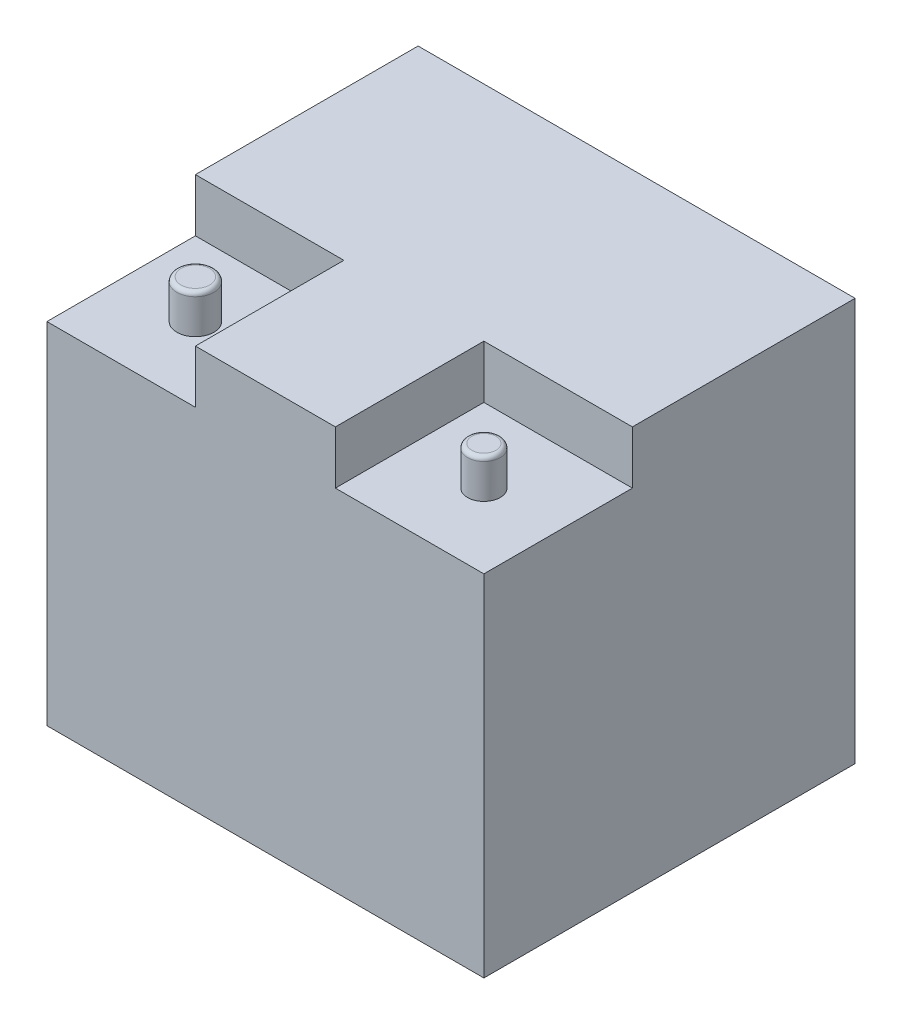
ISO-10303-21;
HEADER;
FILE_DESCRIPTION(('STEP AP214'),'2;1');
FILE_NAME('part.step','',(''),(''),'','','');
FILE_SCHEMA(('AUTOMOTIVE_DESIGN { 1 0 10303 214 1 1 1 1 }'));
ENDSEC;
DATA;
#1=APPLICATION_CONTEXT('core data for automotive mechanical design processes');
#2=APPLICATION_PROTOCOL_DEFINITION('international standard','automotive_design',2000,#1);
#3=PRODUCT_CONTEXT('',#1,'mechanical');
#4=PRODUCT('Part','Part','',(#3));
#5=PRODUCT_RELATED_PRODUCT_CATEGORY('part','',(#4));
#6=PRODUCT_DEFINITION_FORMATION('','',#4);
#7=PRODUCT_DEFINITION_CONTEXT('part definition',#1,'design');
#8=PRODUCT_DEFINITION('design','',#6,#7);
#9=PRODUCT_DEFINITION_SHAPE('','',#8);
#10=(LENGTH_UNIT() NAMED_UNIT(*) SI_UNIT(.MILLI.,.METRE.));
#11=(NAMED_UNIT(*) PLANE_ANGLE_UNIT() SI_UNIT($,.RADIAN.));
#12=(NAMED_UNIT(*) SI_UNIT($,.STERADIAN.) SOLID_ANGLE_UNIT());
#13=UNCERTAINTY_MEASURE_WITH_UNIT(LENGTH_MEASURE(1.E-05),#10,'distance_accuracy_value','');
#14=(GEOMETRIC_REPRESENTATION_CONTEXT(3) GLOBAL_UNCERTAINTY_ASSIGNED_CONTEXT((#13)) GLOBAL_UNIT_ASSIGNED_CONTEXT((#10,
#11,#12)) REPRESENTATION_CONTEXT('',''));
#15=CARTESIAN_POINT('',(0.,0.,0.));
#16=DIRECTION('',(0.,0.,1.));
#17=DIRECTION('',(1.,0.,0.));
#18=AXIS2_PLACEMENT_3D('',#15,#16,#17);
#19=CARTESIAN_POINT('',(33.,165.,87.5));
#20=DIRECTION('',(0.,-1.,0.));
#21=DIRECTION('',(0.,0.,-1.));
#22=AXIS2_PLACEMENT_3D('',#19,#20,#21);
#23=PLANE('',#22);
#24=DIRECTION('',(0.,0.,1.));
#25=VECTOR('',#24,1.);
#26=CARTESIAN_POINT('',(33.,165.,87.5));
#27=LINE('',#26,#25);
#28=CARTESIAN_POINT('',(33.,165.,17.5));
#29=VERTEX_POINT('',#28);
#30=CARTESIAN_POINT('',(33.,165.,87.5));
#31=VERTEX_POINT('',#30);
#32=EDGE_CURVE('E274',#29,#31,#27,.T.);
#33=ORIENTED_EDGE('',*,*,#32,.T.);
#34=DIRECTION('',(1.,0.,0.));
#35=VECTOR('',#34,1.);
#36=CARTESIAN_POINT('',(33.,165.,87.5));
#37=LINE('',#36,#35);
#38=CARTESIAN_POINT('',(103.,165.,87.5));
#39=VERTEX_POINT('',#38);
#40=EDGE_CURVE('E127',#31,#39,#37,.T.);
#41=ORIENTED_EDGE('',*,*,#40,.T.);
#42=DIRECTION('',(0.,0.,-1.));
#43=VECTOR('',#42,1.);
#44=CARTESIAN_POINT('',(103.,165.,87.5));
#45=LINE('',#44,#43);
#46=CARTESIAN_POINT('',(103.,165.,17.5));
#47=VERTEX_POINT('',#46);
#48=EDGE_CURVE('E270',#39,#47,#45,.T.);
#49=ORIENTED_EDGE('',*,*,#48,.T.);
#50=DIRECTION('',(-1.,0.,0.));
#51=VECTOR('',#50,1.);
#52=CARTESIAN_POINT('',(33.,165.,17.5));
#53=LINE('',#52,#51);
#54=EDGE_CURVE('E128',#47,#29,#53,.T.);
#55=ORIENTED_EDGE('',*,*,#54,.T.);
#56=EDGE_LOOP('',(#33,#41,#49,#55));
#57=FACE_BOUND('',#56,.T.);
#58=CARTESIAN_POINT('',(68.,165.,52.5));
#59=DIRECTION('',(0.,-1.,0.));
#60=DIRECTION('',(0.,0.,-1.));
#61=AXIS2_PLACEMENT_3D('',#58,#59,#60);
#62=CIRCLE('',#61,7.7);
#63=CARTESIAN_POINT('',(68.,165.,44.8));
#64=VERTEX_POINT('',#63);
#65=EDGE_CURVE('E157',#64,#64,#62,.F.);
#66=ORIENTED_EDGE('',*,*,#65,.F.);
#67=EDGE_LOOP('',(#66));
#68=FACE_BOUND('',#67,.T.);
#69=ADVANCED_FACE('F31',(#57,#68),#23,.F.);
#70=CARTESIAN_POINT('',(-103.,165.,17.5));
#71=DIRECTION('',(0.,-1.,0.));
#72=DIRECTION('',(0.,0.,-1.));
#73=AXIS2_PLACEMENT_3D('',#70,#71,#72);
#74=PLANE('',#73);
#75=DIRECTION('',(0.,0.,1.));
#76=VECTOR('',#75,1.);
#77=CARTESIAN_POINT('',(-103.,165.,87.5));
#78=LINE('',#77,#76);
#79=CARTESIAN_POINT('',(-103.,165.,17.5));
#80=VERTEX_POINT('',#79);
#81=CARTESIAN_POINT('',(-103.,165.,87.5));
#82=VERTEX_POINT('',#81);
#83=EDGE_CURVE('E230',#80,#82,#78,.T.);
#84=ORIENTED_EDGE('',*,*,#83,.T.);
#85=DIRECTION('',(1.,0.,0.));
#86=VECTOR('',#85,1.);
#87=CARTESIAN_POINT('',(-103.,165.,87.5));
#88=LINE('',#87,#86);
#89=CARTESIAN_POINT('',(-33.,165.,87.5));
#90=VERTEX_POINT('',#89);
#91=EDGE_CURVE('E237',#82,#90,#88,.T.);
#92=ORIENTED_EDGE('',*,*,#91,.T.);
#93=DIRECTION('',(0.,0.,-1.));
#94=VECTOR('',#93,1.);
#95=CARTESIAN_POINT('',(-33.,165.,87.5));
#96=LINE('',#95,#94);
#97=CARTESIAN_POINT('',(-33.,165.,17.5));
#98=VERTEX_POINT('',#97);
#99=EDGE_CURVE('E240',#90,#98,#96,.T.);
#100=ORIENTED_EDGE('',*,*,#99,.T.);
#101=DIRECTION('',(-1.,0.,0.));
#102=VECTOR('',#101,1.);
#103=CARTESIAN_POINT('',(-103.,165.,17.5));
#104=LINE('',#103,#102);
#105=EDGE_CURVE('E247',#98,#80,#104,.T.);
#106=ORIENTED_EDGE('',*,*,#105,.T.);
#107=EDGE_LOOP('',(#84,#92,#100,#106));
#108=FACE_BOUND('',#107,.T.);
#109=CARTESIAN_POINT('',(-68.,165.,52.5));
#110=DIRECTION('',(0.,-1.,0.));
#111=DIRECTION('',(0.,0.,-1.));
#112=AXIS2_PLACEMENT_3D('',#109,#110,#111);
#113=CIRCLE('',#112,8.75000000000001);
#114=CARTESIAN_POINT('',(-68.,165.,43.75));
#115=VERTEX_POINT('',#114);
#116=EDGE_CURVE('E154',#115,#115,#113,.F.);
#117=ORIENTED_EDGE('',*,*,#116,.F.);
#118=EDGE_LOOP('',(#117));
#119=FACE_BOUND('',#118,.T.);
#120=ADVANCED_FACE('F182',(#108,#119),#74,.F.);
#121=CARTESIAN_POINT('',(-103.,190.,-87.5));
#122=DIRECTION('',(1.,0.,0.));
#123=DIRECTION('',(0.,0.,-1.));
#124=AXIS2_PLACEMENT_3D('',#121,#122,#123);
#125=PLANE('',#124);
#126=ORIENTED_EDGE('',*,*,#83,.F.);
#127=DIRECTION('',(0.,1.,0.));
#128=VECTOR('',#127,1.);
#129=CARTESIAN_POINT('',(-103.,165.,17.5));
#130=LINE('',#129,#128);
#131=CARTESIAN_POINT('',(-103.,190.,17.5));
#132=VERTEX_POINT('',#131);
#133=EDGE_CURVE('E232',#80,#132,#130,.T.);
#134=ORIENTED_EDGE('',*,*,#133,.T.);
#135=DIRECTION('',(0.,0.,1.));
#136=VECTOR('',#135,1.);
#137=CARTESIAN_POINT('',(-103.,190.,-87.5));
#138=LINE('',#137,#136);
#139=CARTESIAN_POINT('',(-103.,190.,-87.5));
#140=VERTEX_POINT('',#139);
#141=EDGE_CURVE('E134',#140,#132,#138,.T.);
#142=ORIENTED_EDGE('',*,*,#141,.F.);
#143=DIRECTION('',(0.,-1.,0.));
#144=VECTOR('',#143,1.);
#145=CARTESIAN_POINT('',(-103.,190.,-87.5));
#146=LINE('',#145,#144);
#147=CARTESIAN_POINT('',(-103.,0.,-87.5));
#148=VERTEX_POINT('',#147);
#149=EDGE_CURVE('E144',#140,#148,#146,.T.);
#150=ORIENTED_EDGE('',*,*,#149,.T.);
#151=DIRECTION('',(0.,0.,1.));
#152=VECTOR('',#151,1.);
#153=CARTESIAN_POINT('',(-103.,0.,-87.5));
#154=LINE('',#153,#152);
#155=CARTESIAN_POINT('',(-103.,0.,87.5));
#156=VERTEX_POINT('',#155);
#157=EDGE_CURVE('E250',#148,#156,#154,.T.);
#158=ORIENTED_EDGE('',*,*,#157,.T.);
#159=DIRECTION('',(0.,-1.,0.));
#160=VECTOR('',#159,1.);
#161=CARTESIAN_POINT('',(-103.,190.,87.5));
#162=LINE('',#161,#160);
#163=EDGE_CURVE('E152',#82,#156,#162,.T.);
#164=ORIENTED_EDGE('',*,*,#163,.F.);
#165=EDGE_LOOP('',(#126,#134,#142,#150,#158,#164));
#166=FACE_BOUND('',#165,.T.);
#167=ADVANCED_FACE('F33',(#166),#125,.F.);
#168=CARTESIAN_POINT('',(-103.,190.,87.5));
#169=DIRECTION('',(0.,0.,-1.));
#170=DIRECTION('',(-1.,0.,0.));
#171=AXIS2_PLACEMENT_3D('',#168,#169,#170);
#172=PLANE('',#171);
#173=ORIENTED_EDGE('',*,*,#40,.F.);
#174=DIRECTION('',(0.,1.,0.));
#175=VECTOR('',#174,1.);
#176=CARTESIAN_POINT('',(33.,165.,87.5));
#177=LINE('',#176,#175);
#178=CARTESIAN_POINT('',(33.,190.,87.5));
#179=VERTEX_POINT('',#178);
#180=EDGE_CURVE('E114',#31,#179,#177,.T.);
#181=ORIENTED_EDGE('',*,*,#180,.T.);
#182=DIRECTION('',(1.,0.,0.));
#183=VECTOR('',#182,1.);
#184=CARTESIAN_POINT('',(-103.,190.,87.5));
#185=LINE('',#184,#183);
#186=CARTESIAN_POINT('',(-33.,190.,87.5));
#187=VERTEX_POINT('',#186);
#188=EDGE_CURVE('E125',#187,#179,#185,.T.);
#189=ORIENTED_EDGE('',*,*,#188,.F.);
#190=DIRECTION('',(0.,1.,0.));
#191=VECTOR('',#190,1.);
#192=CARTESIAN_POINT('',(-33.,165.,87.5));
#193=LINE('',#192,#191);
#194=EDGE_CURVE('E54',#90,#187,#193,.T.);
#195=ORIENTED_EDGE('',*,*,#194,.F.);
#196=ORIENTED_EDGE('',*,*,#91,.F.);
#197=ORIENTED_EDGE('',*,*,#163,.T.);
#198=DIRECTION('',(1.,0.,0.));
#199=VECTOR('',#198,1.);
#200=CARTESIAN_POINT('',(-103.,0.,87.5));
#201=LINE('',#200,#199);
#202=CARTESIAN_POINT('',(103.,0.,87.5));
#203=VERTEX_POINT('',#202);
#204=EDGE_CURVE('E255',#156,#203,#201,.T.);
#205=ORIENTED_EDGE('',*,*,#204,.T.);
#206=DIRECTION('',(0.,-1.,0.));
#207=VECTOR('',#206,1.);
#208=CARTESIAN_POINT('',(103.,190.,87.5));
#209=LINE('',#208,#207);
#210=EDGE_CURVE('E150',#39,#203,#209,.T.);
#211=ORIENTED_EDGE('',*,*,#210,.F.);
#212=EDGE_LOOP('',(#173,#181,#189,#195,#196,#197,#205,#211));
#213=FACE_BOUND('',#212,.T.);
#214=ADVANCED_FACE('F124',(#213),#172,.F.);
#215=CARTESIAN_POINT('',(103.,190.,-87.5));
#216=DIRECTION('',(-1.,0.,0.));
#217=DIRECTION('',(0.,0.,1.));
#218=AXIS2_PLACEMENT_3D('',#215,#216,#217);
#219=PLANE('',#218);
#220=DIRECTION('',(0.,0.,-1.));
#221=VECTOR('',#220,1.);
#222=CARTESIAN_POINT('',(103.,190.,-87.5));
#223=LINE('',#222,#221);
#224=CARTESIAN_POINT('',(103.,190.,17.5));
#225=VERTEX_POINT('',#224);
#226=CARTESIAN_POINT('',(103.,190.,-87.5));
#227=VERTEX_POINT('',#226);
#228=EDGE_CURVE('E133',#225,#227,#223,.T.);
#229=ORIENTED_EDGE('',*,*,#228,.F.);
#230=DIRECTION('',(0.,1.,0.));
#231=VECTOR('',#230,1.);
#232=CARTESIAN_POINT('',(103.,165.,17.5));
#233=LINE('',#232,#231);
#234=EDGE_CURVE('E46',#47,#225,#233,.T.);
#235=ORIENTED_EDGE('',*,*,#234,.F.);
#236=ORIENTED_EDGE('',*,*,#48,.F.);
#237=ORIENTED_EDGE('',*,*,#210,.T.);
#238=DIRECTION('',(0.,0.,-1.));
#239=VECTOR('',#238,1.);
#240=CARTESIAN_POINT('',(103.,0.,-87.5));
#241=LINE('',#240,#239);
#242=CARTESIAN_POINT('',(103.,0.,-87.5));
#243=VERTEX_POINT('',#242);
#244=EDGE_CURVE('E258',#203,#243,#241,.T.);
#245=ORIENTED_EDGE('',*,*,#244,.T.);
#246=DIRECTION('',(0.,-1.,0.));
#247=VECTOR('',#246,1.);
#248=CARTESIAN_POINT('',(103.,190.,-87.5));
#249=LINE('',#248,#247);
#250=EDGE_CURVE('E147',#227,#243,#249,.T.);
#251=ORIENTED_EDGE('',*,*,#250,.F.);
#252=EDGE_LOOP('',(#229,#235,#236,#237,#245,#251));
#253=FACE_BOUND('',#252,.T.);
#254=ADVANCED_FACE('F216',(#253),#219,.F.);
#255=CARTESIAN_POINT('',(-103.,190.,-87.5));
#256=DIRECTION('',(0.,0.,1.));
#257=DIRECTION('',(1.,0.,0.));
#258=AXIS2_PLACEMENT_3D('',#255,#256,#257);
#259=PLANE('',#258);
#260=DIRECTION('',(-1.,0.,0.));
#261=VECTOR('',#260,1.);
#262=CARTESIAN_POINT('',(-103.,0.,-87.5));
#263=LINE('',#262,#261);
#264=EDGE_CURVE('E139',#243,#148,#263,.T.);
#265=ORIENTED_EDGE('',*,*,#264,.T.);
#266=ORIENTED_EDGE('',*,*,#149,.F.);
#267=DIRECTION('',(-1.,0.,0.));
#268=VECTOR('',#267,1.);
#269=CARTESIAN_POINT('',(-103.,190.,-87.5));
#270=LINE('',#269,#268);
#271=EDGE_CURVE('E136',#227,#140,#270,.T.);
#272=ORIENTED_EDGE('',*,*,#271,.F.);
#273=ORIENTED_EDGE('',*,*,#250,.T.);
#274=EDGE_LOOP('',(#265,#266,#272,#273));
#275=FACE_BOUND('',#274,.T.);
#276=ADVANCED_FACE('F213',(#275),#259,.F.);
#277=CARTESIAN_POINT('',(-103.,190.,87.5));
#278=DIRECTION('',(0.,1.,0.));
#279=DIRECTION('',(0.,0.,1.));
#280=AXIS2_PLACEMENT_3D('',#277,#278,#279);
#281=PLANE('',#280);
#282=DIRECTION('',(0.,0.,1.));
#283=VECTOR('',#282,1.);
#284=CARTESIAN_POINT('',(33.,190.,87.5));
#285=LINE('',#284,#283);
#286=CARTESIAN_POINT('',(33.,190.,17.5));
#287=VERTEX_POINT('',#286);
#288=EDGE_CURVE('E110',#287,#179,#285,.T.);
#289=ORIENTED_EDGE('',*,*,#288,.F.);
#290=DIRECTION('',(-1.,0.,0.));
#291=VECTOR('',#290,1.);
#292=CARTESIAN_POINT('',(33.,190.,17.5));
#293=LINE('',#292,#291);
#294=EDGE_CURVE('E119',#225,#287,#293,.T.);
#295=ORIENTED_EDGE('',*,*,#294,.F.);
#296=ORIENTED_EDGE('',*,*,#228,.T.);
#297=ORIENTED_EDGE('',*,*,#271,.T.);
#298=ORIENTED_EDGE('',*,*,#141,.T.);
#299=DIRECTION('',(-1.,0.,0.));
#300=VECTOR('',#299,1.);
#301=CARTESIAN_POINT('',(-103.,190.,17.5));
#302=LINE('',#301,#300);
#303=CARTESIAN_POINT('',(-33.,190.,17.5));
#304=VERTEX_POINT('',#303);
#305=EDGE_CURVE('E238',#304,#132,#302,.T.);
#306=ORIENTED_EDGE('',*,*,#305,.F.);
#307=DIRECTION('',(0.,0.,-1.));
#308=VECTOR('',#307,1.);
#309=CARTESIAN_POINT('',(-33.,190.,87.5));
#310=LINE('',#309,#308);
#311=EDGE_CURVE('E132',#187,#304,#310,.T.);
#312=ORIENTED_EDGE('',*,*,#311,.F.);
#313=ORIENTED_EDGE('',*,*,#188,.T.);
#314=EDGE_LOOP('',(#289,#295,#296,#297,#298,#306,#312,#313));
#315=FACE_BOUND('',#314,.T.);
#316=ADVANCED_FACE('F130',(#315),#281,.T.);
#317=CARTESIAN_POINT('',(-103.,0.,87.5));
#318=DIRECTION('',(0.,1.,0.));
#319=DIRECTION('',(0.,0.,1.));
#320=AXIS2_PLACEMENT_3D('',#317,#318,#319);
#321=PLANE('',#320);
#322=ORIENTED_EDGE('',*,*,#157,.F.);
#323=ORIENTED_EDGE('',*,*,#264,.F.);
#324=ORIENTED_EDGE('',*,*,#244,.F.);
#325=ORIENTED_EDGE('',*,*,#204,.F.);
#326=EDGE_LOOP('',(#322,#323,#324,#325));
#327=FACE_BOUND('',#326,.T.);
#328=ADVANCED_FACE('F204',(#327),#321,.F.);
#329=CARTESIAN_POINT('',(-103.,165.,17.5));
#330=DIRECTION('',(0.,0.,-1.));
#331=DIRECTION('',(-1.,0.,0.));
#332=AXIS2_PLACEMENT_3D('',#329,#330,#331);
#333=PLANE('',#332);
#334=ORIENTED_EDGE('',*,*,#305,.T.);
#335=ORIENTED_EDGE('',*,*,#133,.F.);
#336=ORIENTED_EDGE('',*,*,#105,.F.);
#337=DIRECTION('',(0.,1.,0.));
#338=VECTOR('',#337,1.);
#339=CARTESIAN_POINT('',(-33.,165.,17.5));
#340=LINE('',#339,#338);
#341=EDGE_CURVE('E251',#98,#304,#340,.T.);
#342=ORIENTED_EDGE('',*,*,#341,.T.);
#343=EDGE_LOOP('',(#334,#335,#336,#342));
#344=FACE_BOUND('',#343,.T.);
#345=ADVANCED_FACE('F201',(#344),#333,.F.);
#346=CARTESIAN_POINT('',(-33.,165.,87.5));
#347=DIRECTION('',(1.,0.,0.));
#348=DIRECTION('',(0.,0.,-1.));
#349=AXIS2_PLACEMENT_3D('',#346,#347,#348);
#350=PLANE('',#349);
#351=ORIENTED_EDGE('',*,*,#311,.T.);
#352=ORIENTED_EDGE('',*,*,#341,.F.);
#353=ORIENTED_EDGE('',*,*,#99,.F.);
#354=ORIENTED_EDGE('',*,*,#194,.T.);
#355=EDGE_LOOP('',(#351,#352,#353,#354));
#356=FACE_BOUND('',#355,.T.);
#357=ADVANCED_FACE('F199',(#356),#350,.F.);
#358=CARTESIAN_POINT('',(33.,165.,87.5));
#359=DIRECTION('',(-1.,0.,0.));
#360=DIRECTION('',(0.,0.,1.));
#361=AXIS2_PLACEMENT_3D('',#358,#359,#360);
#362=PLANE('',#361);
#363=ORIENTED_EDGE('',*,*,#288,.T.);
#364=ORIENTED_EDGE('',*,*,#180,.F.);
#365=ORIENTED_EDGE('',*,*,#32,.F.);
#366=DIRECTION('',(0.,1.,0.));
#367=VECTOR('',#366,1.);
#368=CARTESIAN_POINT('',(33.,165.,17.5));
#369=LINE('',#368,#367);
#370=EDGE_CURVE('E116',#29,#287,#369,.T.);
#371=ORIENTED_EDGE('',*,*,#370,.T.);
#372=EDGE_LOOP('',(#363,#364,#365,#371));
#373=FACE_BOUND('',#372,.T.);
#374=ADVANCED_FACE('F112',(#373),#362,.F.);
#375=CARTESIAN_POINT('',(33.,165.,17.5));
#376=DIRECTION('',(0.,0.,-1.));
#377=DIRECTION('',(-1.,0.,0.));
#378=AXIS2_PLACEMENT_3D('',#375,#376,#377);
#379=PLANE('',#378);
#380=ORIENTED_EDGE('',*,*,#294,.T.);
#381=ORIENTED_EDGE('',*,*,#370,.F.);
#382=ORIENTED_EDGE('',*,*,#54,.F.);
#383=ORIENTED_EDGE('',*,*,#234,.T.);
#384=EDGE_LOOP('',(#380,#381,#382,#383));
#385=FACE_BOUND('',#384,.T.);
#386=ADVANCED_FACE('F195',(#385),#379,.F.);
#387=CARTESIAN_POINT('',(-68.,183.3,52.5));
#388=DIRECTION('',(0.,-1.,0.));
#389=DIRECTION('',(0.,0.,-1.));
#390=AXIS2_PLACEMENT_3D('',#387,#388,#389);
#391=CYLINDRICAL_SURFACE('',#390,8.75000000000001);
#392=CARTESIAN_POINT('',(-68.,181.3,52.5));
#393=DIRECTION('',(0.,1.,0.));
#394=DIRECTION('',(0.,0.,1.));
#395=AXIS2_PLACEMENT_3D('',#392,#393,#394);
#396=CIRCLE('',#395,8.75000000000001);
#397=CARTESIAN_POINT('',(-68.,181.3,61.25));
#398=VERTEX_POINT('',#397);
#399=EDGE_CURVE('E163',#398,#398,#396,.F.);
#400=ORIENTED_EDGE('',*,*,#399,.T.);
#401=EDGE_LOOP('',(#400));
#402=FACE_BOUND('',#401,.T.);
#403=ORIENTED_EDGE('',*,*,#116,.T.);
#404=EDGE_LOOP('',(#403));
#405=FACE_BOUND('',#404,.T.);
#406=ADVANCED_FACE('F193',(#402,#405),#391,.T.);
#407=CARTESIAN_POINT('',(-68.,183.3,52.5));
#408=DIRECTION('',(0.,1.,0.));
#409=DIRECTION('',(0.,0.,1.));
#410=AXIS2_PLACEMENT_3D('',#407,#408,#409);
#411=PLANE('',#410);
#412=CARTESIAN_POINT('',(-68.,183.3,52.5));
#413=DIRECTION('',(0.,1.,0.));
#414=DIRECTION('',(0.,0.,1.));
#415=AXIS2_PLACEMENT_3D('',#412,#413,#414);
#416=CIRCLE('',#415,6.75000000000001);
#417=CARTESIAN_POINT('',(-68.,183.3,59.25));
#418=VERTEX_POINT('',#417);
#419=EDGE_CURVE('E160',#418,#418,#416,.T.);
#420=ORIENTED_EDGE('',*,*,#419,.T.);
#421=EDGE_LOOP('',(#420));
#422=FACE_BOUND('',#421,.T.);
#423=ADVANCED_FACE('F283',(#422),#411,.T.);
#424=CARTESIAN_POINT('',(68.,183.3,52.5));
#425=DIRECTION('',(0.,-1.,0.));
#426=DIRECTION('',(0.,0.,-1.));
#427=AXIS2_PLACEMENT_3D('',#424,#425,#426);
#428=CYLINDRICAL_SURFACE('',#427,7.7);
#429=CARTESIAN_POINT('',(68.,181.3,52.5));
#430=DIRECTION('',(0.,1.,0.));
#431=DIRECTION('',(0.,0.,1.));
#432=AXIS2_PLACEMENT_3D('',#429,#430,#431);
#433=CIRCLE('',#432,7.7);
#434=CARTESIAN_POINT('',(68.,181.3,60.2));
#435=VERTEX_POINT('',#434);
#436=EDGE_CURVE('E11',#435,#435,#433,.F.);
#437=ORIENTED_EDGE('',*,*,#436,.T.);
#438=EDGE_LOOP('',(#437));
#439=FACE_BOUND('',#438,.T.);
#440=ORIENTED_EDGE('',*,*,#65,.T.);
#441=EDGE_LOOP('',(#440));
#442=FACE_BOUND('',#441,.T.);
#443=ADVANCED_FACE('F288',(#439,#442),#428,.T.);
#444=CARTESIAN_POINT('',(68.,183.3,52.5));
#445=DIRECTION('',(0.,1.,0.));
#446=DIRECTION('',(0.,0.,1.));
#447=AXIS2_PLACEMENT_3D('',#444,#445,#446);
#448=PLANE('',#447);
#449=CARTESIAN_POINT('',(68.,183.3,52.5));
#450=DIRECTION('',(0.,1.,0.));
#451=DIRECTION('',(0.,0.,1.));
#452=AXIS2_PLACEMENT_3D('',#449,#450,#451);
#453=CIRCLE('',#452,5.7);
#454=CARTESIAN_POINT('',(68.,183.3,58.2));
#455=VERTEX_POINT('',#454);
#456=EDGE_CURVE('E39',#455,#455,#453,.T.);
#457=ORIENTED_EDGE('',*,*,#456,.T.);
#458=EDGE_LOOP('',(#457));
#459=FACE_BOUND('',#458,.T.);
#460=ADVANCED_FACE('F168',(#459),#448,.T.);
#461=CARTESIAN_POINT('',(-68.,181.3,52.5));
#462=DIRECTION('',(0.,1.,0.));
#463=DIRECTION('',(0.,0.,1.));
#464=AXIS2_PLACEMENT_3D('',#461,#462,#463);
#465=TOROIDAL_SURFACE('',#464,6.75000000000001,2.);
#466=ORIENTED_EDGE('',*,*,#399,.F.);
#467=EDGE_LOOP('',(#466));
#468=FACE_BOUND('',#467,.T.);
#469=ORIENTED_EDGE('',*,*,#419,.F.);
#470=EDGE_LOOP('',(#469));
#471=FACE_BOUND('',#470,.T.);
#472=ADVANCED_FACE('F172',(#468,#471),#465,.T.);
#473=CARTESIAN_POINT('',(68.,181.3,52.5));
#474=DIRECTION('',(0.,1.,0.));
#475=DIRECTION('',(0.,0.,1.));
#476=AXIS2_PLACEMENT_3D('',#473,#474,#475);
#477=TOROIDAL_SURFACE('',#476,5.7,2.);
#478=ORIENTED_EDGE('',*,*,#436,.F.);
#479=EDGE_LOOP('',(#478));
#480=FACE_BOUND('',#479,.T.);
#481=ORIENTED_EDGE('',*,*,#456,.F.);
#482=EDGE_LOOP('',(#481));
#483=FACE_BOUND('',#482,.T.);
#484=ADVANCED_FACE('F170',(#480,#483),#477,.T.);
#485=CLOSED_SHELL('',(#69,#120,#167,#214,#254,#276,#316,#328,#345,#357,#374,#386,#406,#423,#443,
#460,#472,#484));
#486=MANIFOLD_SOLID_BREP('B2',#485);
#487=ADVANCED_BREP_SHAPE_REPRESENTATION('',(#18,#486),#14);
#488=SHAPE_DEFINITION_REPRESENTATION(#9,#487);
ENDSEC;
END-ISO-10303-21;
